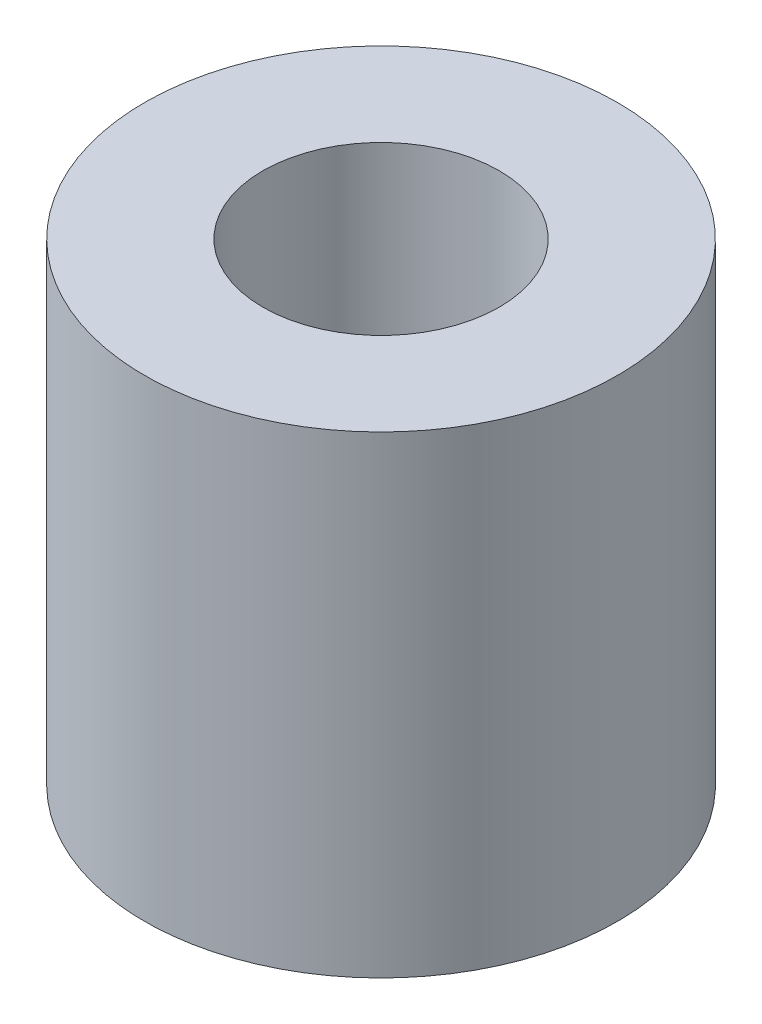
from build123d import *


with BuildPart() as part:
    # Sketch1 → Revolve1 (revolve)
    with BuildSketch(Plane.XY, mode=Mode.PRIVATE) as revolve1_sk:
        Polygon((2.5, 5), (5, 5), (5, -5), (3.175, -5), (3.175, 0), (2.5, 0), align=None)
    revolve(revolve1_sk.sketch.rotate(Axis((0, 0, 0), (0, 1, 0)), 90), axis=Axis((0, 0, 0), (0, 1, 0)))


solid = part.part
